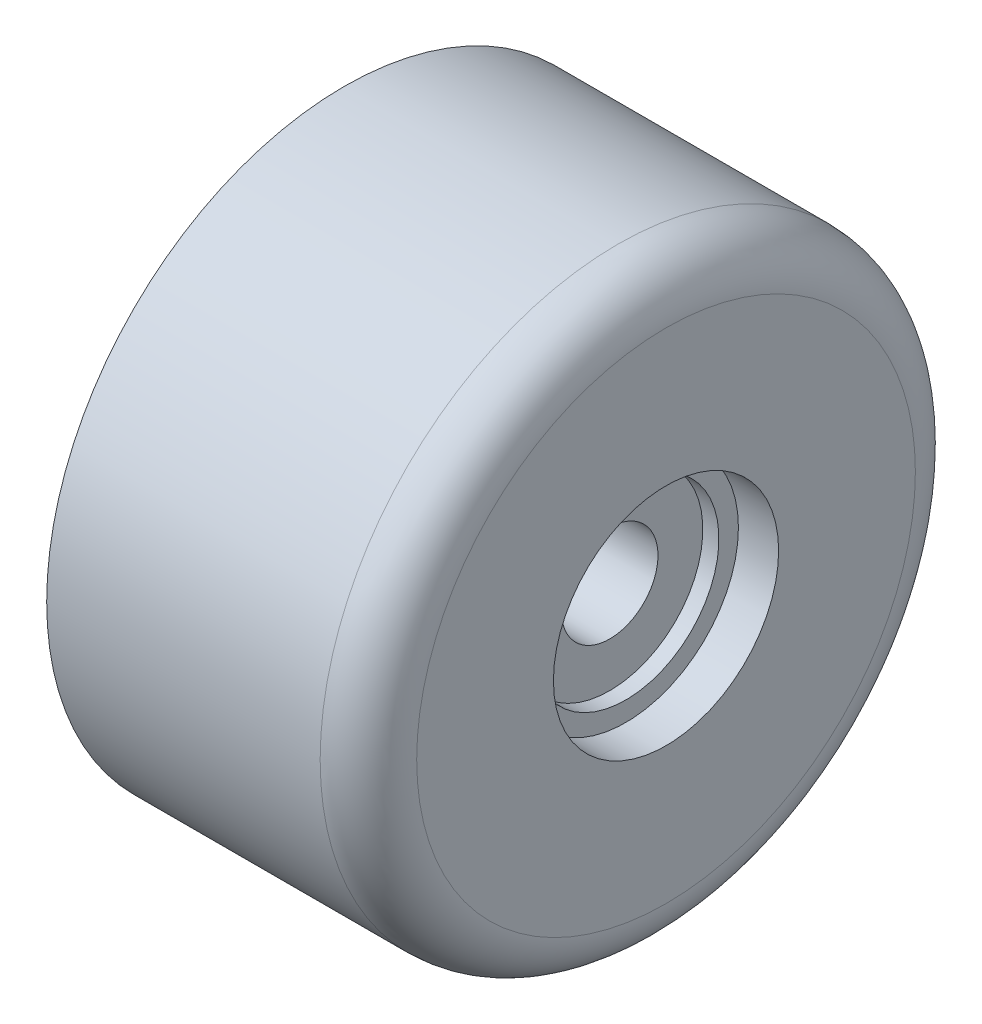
from build123d import *


with BuildPart() as part:
    # izim1 → D_nd_r1 (revolve)
    with BuildSketch(Plane.XY, mode=Mode.PRIVATE) as d_nd_r1_sk:
        with BuildLine():
            Line((0, 18.5), (0, 17.113316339))
            Line((0, 17.113316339), (17.5, 17.113316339))
            Line((17.5, 17.113316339), (18.359183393, 15.5))
            Line((18.359183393, 15.5), (18.359183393, 7.615736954))
            Line((18.359183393, 7.615736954), (17, 7.615736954))
            Line((17, 7.615736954), (17, 6.41400242))
            Line((17, 6.41400242), (15.568058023, 6.41400242))
            Line((15.568058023, 6.41400242), (15.568058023, 3.545345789))
            Line((15.568058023, 3.545345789), (0, 3.545345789))
            Line((0, 3.545345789), (0, 3))
            Line((0, 3), (16.5, 3))
            Line((16.5, 3), (16.5, 5.787765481))
            Line((16.5, 5.787765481), (17.5, 5.787765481))
            Line((17.5, 5.787765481), (17.5, 7))
            Line((17.5, 7), (20, 7))
            Line((20, 7), (20, 15.5))
            ThreePointArc((20, 15.5), (19.121320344, 17.621320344), (17, 18.5))
            Line((17, 18.5), (0, 18.5))
        make_face()
    revolve(d_nd_r1_sk.sketch.rotate(Axis((0, 0, 0), (1, 0, 0)), 90), axis=Axis((0, 0, 0), (1, 0, 0)))


solid = part.part
